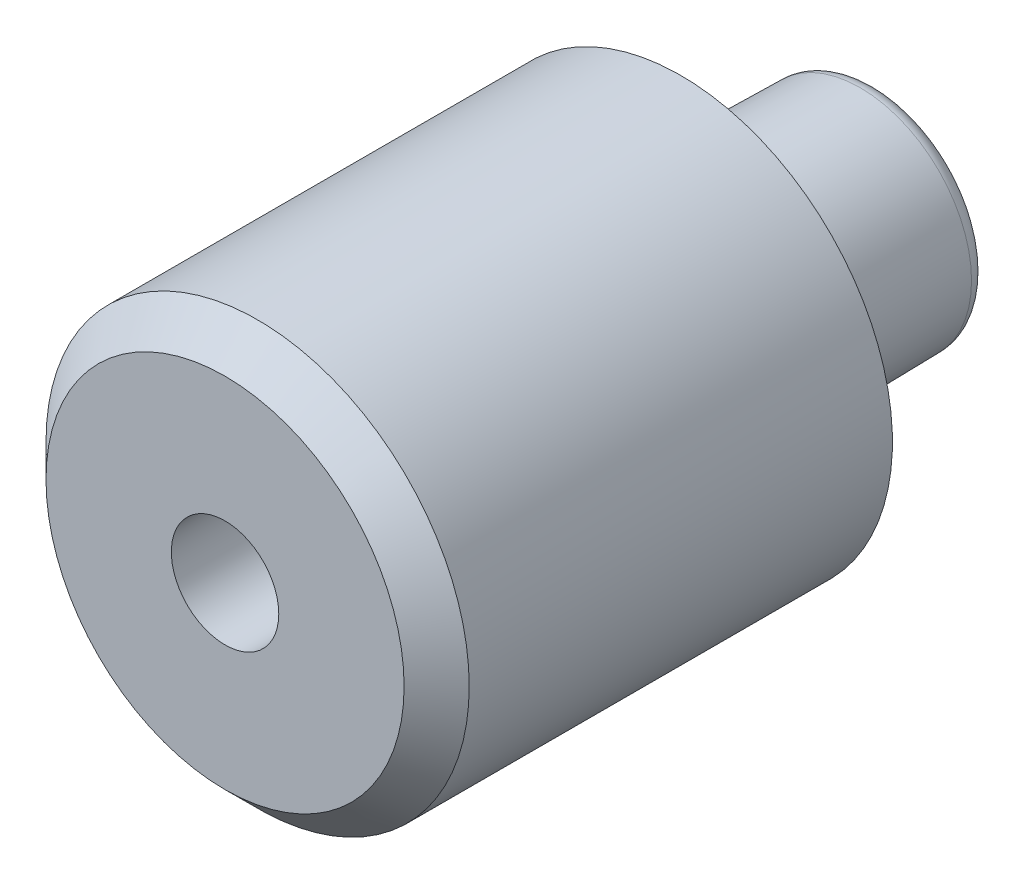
ISO-10303-21;
HEADER;
FILE_DESCRIPTION(('STEP AP214'),'2;1');
FILE_NAME('part.step','',(''),(''),'','','');
FILE_SCHEMA(('AUTOMOTIVE_DESIGN { 1 0 10303 214 1 1 1 1 }'));
ENDSEC;
DATA;
#1=APPLICATION_CONTEXT('core data for automotive mechanical design processes');
#2=APPLICATION_PROTOCOL_DEFINITION('international standard','automotive_design',2000,#1);
#3=PRODUCT_CONTEXT('',#1,'mechanical');
#4=PRODUCT('Part','Part','',(#3));
#5=PRODUCT_RELATED_PRODUCT_CATEGORY('part','',(#4));
#6=PRODUCT_DEFINITION_FORMATION('','',#4);
#7=PRODUCT_DEFINITION_CONTEXT('part definition',#1,'design');
#8=PRODUCT_DEFINITION('design','',#6,#7);
#9=PRODUCT_DEFINITION_SHAPE('','',#8);
#10=(LENGTH_UNIT() NAMED_UNIT(*) SI_UNIT(.MILLI.,.METRE.));
#11=(NAMED_UNIT(*) PLANE_ANGLE_UNIT() SI_UNIT($,.RADIAN.));
#12=(NAMED_UNIT(*) SI_UNIT($,.STERADIAN.) SOLID_ANGLE_UNIT());
#13=UNCERTAINTY_MEASURE_WITH_UNIT(LENGTH_MEASURE(1.E-05),#10,'distance_accuracy_value','');
#14=(GEOMETRIC_REPRESENTATION_CONTEXT(3) GLOBAL_UNCERTAINTY_ASSIGNED_CONTEXT((#13)) GLOBAL_UNIT_ASSIGNED_CONTEXT((#10,
#11,#12)) REPRESENTATION_CONTEXT('',''));
#15=CARTESIAN_POINT('',(0.,0.,0.));
#16=DIRECTION('',(0.,0.,1.));
#17=DIRECTION('',(1.,0.,0.));
#18=AXIS2_PLACEMENT_3D('',#15,#16,#17);
#19=CARTESIAN_POINT('',(0.,0.,11.3076118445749));
#20=DIRECTION('',(0.,0.,-1.));
#21=DIRECTION('',(1.,0.,0.));
#22=AXIS2_PLACEMENT_3D('',#19,#20,#21);
#23=CONICAL_SURFACE('',#22,9.19238815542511,0.785398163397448);
#24=CARTESIAN_POINT('',(1.04744440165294E-13,0.,15.));
#25=DIRECTION('',(0.,0.,-1.));
#26=DIRECTION('',(-1.,0.,0.));
#27=AXIS2_PLACEMENT_3D('',#24,#25,#26);
#28=CIRCLE('',#27,5.5);
#29=CARTESIAN_POINT('',(-5.4999999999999,0.,15.));
#30=VERTEX_POINT('',#29);
#31=CARTESIAN_POINT('',(5.50000000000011,0.,15.));
#32=VERTEX_POINT('',#31);
#33=EDGE_CURVE('E59',#30,#32,#28,.T.);
#34=ORIENTED_EDGE('',*,*,#33,.T.);
#35=CARTESIAN_POINT('',(5.50000026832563,0.,14.9999997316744));
#36=CARTESIAN_POINT('',(6.50000039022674,0.,13.9999996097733));
#37=B_SPLINE_CURVE_WITH_KNOTS('',1,(#35,#36),.UNSPECIFIED.,.F.,.F.,(2,2),(0.598321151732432,
0.707106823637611),.UNSPECIFIED.);
#38=CARTESIAN_POINT('',(6.5000000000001,0.,14.));
#39=VERTEX_POINT('',#38);
#40=EDGE_CURVE('E46',#32,#39,#37,.T.);
#41=ORIENTED_EDGE('',*,*,#40,.T.);
#42=CARTESIAN_POINT('',(0.,0.,14.));
#43=DIRECTION('',(0.,0.,1.));
#44=DIRECTION('',(-1.,0.,0.));
#45=AXIS2_PLACEMENT_3D('',#42,#43,#44);
#46=CIRCLE('',#45,6.5);
#47=CARTESIAN_POINT('',(-6.4999999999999,0.,14.));
#48=VERTEX_POINT('',#47);
#49=EDGE_CURVE('E97',#39,#48,#46,.T.);
#50=ORIENTED_EDGE('',*,*,#49,.T.);
#51=CARTESIAN_POINT('',(0.,0.,14.));
#52=DIRECTION('',(0.,0.,1.));
#53=DIRECTION('',(-1.,0.,0.));
#54=AXIS2_PLACEMENT_3D('',#51,#52,#53);
#55=CIRCLE('',#54,6.5);
#56=EDGE_CURVE('E11',#48,#39,#55,.T.);
#57=ORIENTED_EDGE('',*,*,#56,.T.);
#58=ORIENTED_EDGE('',*,*,#40,.F.);
#59=CARTESIAN_POINT('',(1.04744440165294E-13,0.,15.));
#60=DIRECTION('',(0.,0.,-1.));
#61=DIRECTION('',(-1.,0.,0.));
#62=AXIS2_PLACEMENT_3D('',#59,#60,#61);
#63=CIRCLE('',#62,5.5);
#64=EDGE_CURVE('E94',#32,#30,#63,.T.);
#65=ORIENTED_EDGE('',*,*,#64,.T.);
#66=EDGE_LOOP('',(#34,#41,#50,#57,#58,#65));
#67=FACE_BOUND('',#66,.T.);
#68=ADVANCED_FACE('F38',(#67),#23,.T.);
#69=CARTESIAN_POINT('',(0.,0.,8.));
#70=DIRECTION('',(0.,0.,-1.));
#71=DIRECTION('',(-1.,0.,0.));
#72=AXIS2_PLACEMENT_3D('',#69,#70,#71);
#73=CYLINDRICAL_SURFACE('',#72,6.5);
#74=ORIENTED_EDGE('',*,*,#49,.F.);
#75=ORIENTED_EDGE('',*,*,#56,.F.);
#76=CARTESIAN_POINT('',(-6.4999999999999,0.,13.9999990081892));
#77=CARTESIAN_POINT('',(-6.5,0.,0.999998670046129));
#78=B_SPLINE_CURVE_WITH_KNOTS('',1,(#76,#77),.UNSPECIFIED.,.F.,.F.,(2,2),(0.0833333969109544,
0.916666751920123),.UNSPECIFIED.);
#79=CARTESIAN_POINT('',(-6.5,0.,1.00000000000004));
#80=VERTEX_POINT('',#79);
#81=EDGE_CURVE('E132',#48,#80,#78,.T.);
#82=ORIENTED_EDGE('',*,*,#81,.T.);
#83=CARTESIAN_POINT('',(0.,0.,1.));
#84=DIRECTION('',(0.,0.,-1.));
#85=DIRECTION('',(-1.,0.,0.));
#86=AXIS2_PLACEMENT_3D('',#83,#84,#85);
#87=CIRCLE('',#86,6.5);
#88=EDGE_CURVE('E137',#80,#80,#87,.T.);
#89=ORIENTED_EDGE('',*,*,#88,.F.);
#90=ORIENTED_EDGE('',*,*,#81,.F.);
#91=EDGE_LOOP('',(#74,#75,#82,#89,#90));
#92=FACE_BOUND('',#91,.T.);
#93=ADVANCED_FACE('F182',(#92),#73,.T.);
#94=CARTESIAN_POINT('',(-7.1499999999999,-11.4315353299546,15.));
#95=DIRECTION('',(0.,0.,1.));
#96=DIRECTION('',(1.,0.,0.));
#97=AXIS2_PLACEMENT_3D('',#94,#95,#96);
#98=PLANE('',#97);
#99=CARTESIAN_POINT('',(0.,0.,15.));
#100=DIRECTION('',(0.,0.,1.));
#101=DIRECTION('',(1.,0.,0.));
#102=AXIS2_PLACEMENT_3D('',#99,#100,#101);
#103=CIRCLE('',#102,1.64999999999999);
#104=CARTESIAN_POINT('',(1.64999999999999,0.,15.));
#105=VERTEX_POINT('',#104);
#106=EDGE_CURVE('E95',#105,#105,#103,.T.);
#107=ORIENTED_EDGE('',*,*,#106,.F.);
#108=EDGE_LOOP('',(#107));
#109=FACE_BOUND('',#108,.T.);
#110=ORIENTED_EDGE('',*,*,#64,.F.);
#111=ORIENTED_EDGE('',*,*,#33,.F.);
#112=EDGE_LOOP('',(#110,#111));
#113=FACE_BOUND('',#112,.T.);
#114=ADVANCED_FACE('F185',(#109,#113),#98,.T.);
#115=CARTESIAN_POINT('',(0.,0.,-4.5));
#116=DIRECTION('',(0.,0.,-1.));
#117=DIRECTION('',(-1.,0.,0.));
#118=AXIS2_PLACEMENT_3D('',#115,#116,#117);
#119=TOROIDAL_SURFACE('',#118,2.92137604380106,0.5);
#120=CARTESIAN_POINT('',(0.,0.,-4.50872620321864));
#121=DIRECTION('',(0.,0.,-1.));
#122=DIRECTION('',(-1.,0.,0.));
#123=AXIS2_PLACEMENT_3D('',#120,#121,#122);
#124=CIRCLE('',#123,3.42129989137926);
#125=CARTESIAN_POINT('',(-3.4212998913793,0.,-4.50872620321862));
#126=VERTEX_POINT('',#125);
#127=EDGE_CURVE('E138',#126,#126,#124,.T.);
#128=ORIENTED_EDGE('',*,*,#127,.T.);
#129=CARTESIAN_POINT('',(-3.4212998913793,0.,-4.50872620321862));
#130=CARTESIAN_POINT('',(-3.41272467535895,0.,-4.99999999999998));
#131=CARTESIAN_POINT('',(-2.9213760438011,0.,-5.));
#132=(BOUNDED_CURVE() B_SPLINE_CURVE(2,(#129,#130,#131),.UNSPECIFIED.,.F.,
.F.) B_SPLINE_CURVE_WITH_KNOTS((3,3),(0.,0.5),
.UNSPECIFIED.) CURVE() GEOMETRIC_REPRESENTATION_ITEM() RATIONAL_B_SPLINE_CURVE((1.,
0.713250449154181,1.)) REPRESENTATION_ITEM(''));
#133=CARTESIAN_POINT('',(-2.9213760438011,0.,-5.));
#134=VERTEX_POINT('',#133);
#135=EDGE_CURVE('E121',#126,#134,#132,.T.);
#136=ORIENTED_EDGE('',*,*,#135,.T.);
#137=CARTESIAN_POINT('',(0.,0.,-5.));
#138=DIRECTION('',(0.,0.,1.));
#139=DIRECTION('',(-1.,0.,0.));
#140=AXIS2_PLACEMENT_3D('',#137,#138,#139);
#141=CIRCLE('',#140,2.92137604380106);
#142=EDGE_CURVE('E127',#134,#134,#141,.T.);
#143=ORIENTED_EDGE('',*,*,#142,.T.);
#144=ORIENTED_EDGE('',*,*,#135,.F.);
#145=EDGE_LOOP('',(#128,#136,#143,#144));
#146=FACE_BOUND('',#145,.T.);
#147=ADVANCED_FACE('F187',(#146),#119,.T.);
#148=CARTESIAN_POINT('',(0.,0.,0.));
#149=DIRECTION('',(0.,0.,1.));
#150=DIRECTION('',(-1.,0.,0.));
#151=AXIS2_PLACEMENT_3D('',#148,#149,#150);
#152=CONICAL_SURFACE('',#151,3.5,0.0174532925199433);
#153=ORIENTED_EDGE('',*,*,#127,.F.);
#154=CARTESIAN_POINT('',(-3.4212998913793,0.,-4.50872620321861));
#155=CARTESIAN_POINT('',(-3.5,0.,0.));
#156=B_SPLINE_CURVE_WITH_KNOTS('',1,(#154,#155),.UNSPECIFIED.,.F.,.F.,(2,2),(0.,1.),.UNSPECIFIED.);
#157=CARTESIAN_POINT('',(-3.5,0.,0.));
#158=VERTEX_POINT('',#157);
#159=EDGE_CURVE('E110',#126,#158,#156,.T.);
#160=ORIENTED_EDGE('',*,*,#159,.T.);
#161=CARTESIAN_POINT('',(0.,0.,0.));
#162=DIRECTION('',(0.,0.,-1.));
#163=DIRECTION('',(-1.,0.,0.));
#164=AXIS2_PLACEMENT_3D('',#161,#162,#163);
#165=CIRCLE('',#164,3.5);
#166=EDGE_CURVE('E116',#158,#158,#165,.T.);
#167=ORIENTED_EDGE('',*,*,#166,.T.);
#168=ORIENTED_EDGE('',*,*,#159,.F.);
#169=EDGE_LOOP('',(#153,#160,#167,#168));
#170=FACE_BOUND('',#169,.T.);
#171=ADVANCED_FACE('F194',(#170),#152,.T.);
#172=CARTESIAN_POINT('',(6.71916490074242,-6.07196608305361,-5.));
#173=DIRECTION('',(0.,0.,-1.));
#174=DIRECTION('',(-1.,0.,0.));
#175=AXIS2_PLACEMENT_3D('',#172,#173,#174);
#176=PLANE('',#175);
#177=ORIENTED_EDGE('',*,*,#142,.F.);
#178=EDGE_LOOP('',(#177));
#179=FACE_BOUND('',#178,.T.);
#180=ADVANCED_FACE('F222',(#179),#176,.T.);
#181=CARTESIAN_POINT('',(0.,0.,0.5));
#182=DIRECTION('',(0.,0.,-1.));
#183=DIRECTION('',(-1.,0.,0.));
#184=AXIS2_PLACEMENT_3D('',#181,#182,#183);
#185=CYLINDRICAL_SURFACE('',#184,3.5);
#186=CARTESIAN_POINT('',(0.,0.,1.));
#187=DIRECTION('',(0.,0.,1.));
#188=DIRECTION('',(-1.,0.,0.));
#189=AXIS2_PLACEMENT_3D('',#186,#187,#188);
#190=CIRCLE('',#189,3.5);
#191=CARTESIAN_POINT('',(-3.5,0.,1.00000000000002));
#192=VERTEX_POINT('',#191);
#193=EDGE_CURVE('E105',#192,#192,#190,.T.);
#194=ORIENTED_EDGE('',*,*,#193,.F.);
#195=CARTESIAN_POINT('',(-3.5,0.,1.00000305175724));
#196=CARTESIAN_POINT('',(-3.5,0.,5.31746900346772E-07));
#197=B_SPLINE_CURVE_WITH_KNOTS('',1,(#195,#196),.UNSPECIFIED.,.F.,.F.,(2,2),(0.0833307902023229,
0.91666622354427),.UNSPECIFIED.);
#198=EDGE_CURVE('E102',#192,#158,#197,.T.);
#199=ORIENTED_EDGE('',*,*,#198,.T.);
#200=ORIENTED_EDGE('',*,*,#166,.F.);
#201=ORIENTED_EDGE('',*,*,#198,.F.);
#202=EDGE_LOOP('',(#194,#199,#200,#201));
#203=FACE_BOUND('',#202,.T.);
#204=ADVANCED_FACE('F231',(#203),#185,.T.);
#205=CARTESIAN_POINT('',(14.95,-13.5099962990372,0.999999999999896));
#206=DIRECTION('',(0.,0.,-1.));
#207=DIRECTION('',(-1.,0.,0.));
#208=AXIS2_PLACEMENT_3D('',#205,#206,#207);
#209=PLANE('',#208);
#210=ORIENTED_EDGE('',*,*,#88,.T.);
#211=EDGE_LOOP('',(#210));
#212=FACE_BOUND('',#211,.T.);
#213=ORIENTED_EDGE('',*,*,#193,.T.);
#214=EDGE_LOOP('',(#213));
#215=FACE_BOUND('',#214,.T.);
#216=ADVANCED_FACE('F88',(#212,#215),#209,.T.);
#217=CARTESIAN_POINT('',(0.,0.,2.99999999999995));
#218=DIRECTION('',(0.,0.,1.));
#219=DIRECTION('',(1.,0.,0.));
#220=AXIS2_PLACEMENT_3D('',#217,#218,#219);
#221=CONICAL_SURFACE('',#220,1.65,1.02974425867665);
#222=CARTESIAN_POINT('',(0.,0.,2.00857997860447));
#223=VERTEX_POINT('',#222);
#224=VERTEX_LOOP('',#223);
#225=FACE_BOUND('',#224,.T.);
#226=CARTESIAN_POINT('',(0.,0.,2.99999999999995));
#227=DIRECTION('',(0.,0.,1.));
#228=DIRECTION('',(1.,0.,0.));
#229=AXIS2_PLACEMENT_3D('',#226,#227,#228);
#230=CIRCLE('',#229,1.65);
#231=CARTESIAN_POINT('',(1.65,0.,2.99999999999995));
#232=VERTEX_POINT('',#231);
#233=EDGE_CURVE('E92',#232,#232,#230,.T.);
#234=ORIENTED_EDGE('',*,*,#233,.T.);
#235=EDGE_LOOP('',(#234));
#236=FACE_BOUND('',#235,.T.);
#237=ADVANCED_FACE('F84',(#225,#236),#221,.F.);
#238=CARTESIAN_POINT('',(0.,0.,14.9999999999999));
#239=DIRECTION('',(0.,0.,1.));
#240=DIRECTION('',(1.,0.,0.));
#241=AXIS2_PLACEMENT_3D('',#238,#239,#240);
#242=CYLINDRICAL_SURFACE('',#241,1.64999999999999);
#243=ORIENTED_EDGE('',*,*,#233,.F.);
#244=EDGE_LOOP('',(#243));
#245=FACE_BOUND('',#244,.T.);
#246=ORIENTED_EDGE('',*,*,#106,.T.);
#247=EDGE_LOOP('',(#246));
#248=FACE_BOUND('',#247,.T.);
#249=ADVANCED_FACE('F87',(#245,#248),#242,.F.);
#250=CLOSED_SHELL('',(#68,#93,#114,#147,#171,#180,#204,#216,#237,#249));
#251=MANIFOLD_SOLID_BREP('B2',#250);
#252=ADVANCED_BREP_SHAPE_REPRESENTATION('',(#18,#251),#14);
#253=SHAPE_DEFINITION_REPRESENTATION(#9,#252);
ENDSEC;
END-ISO-10303-21;
